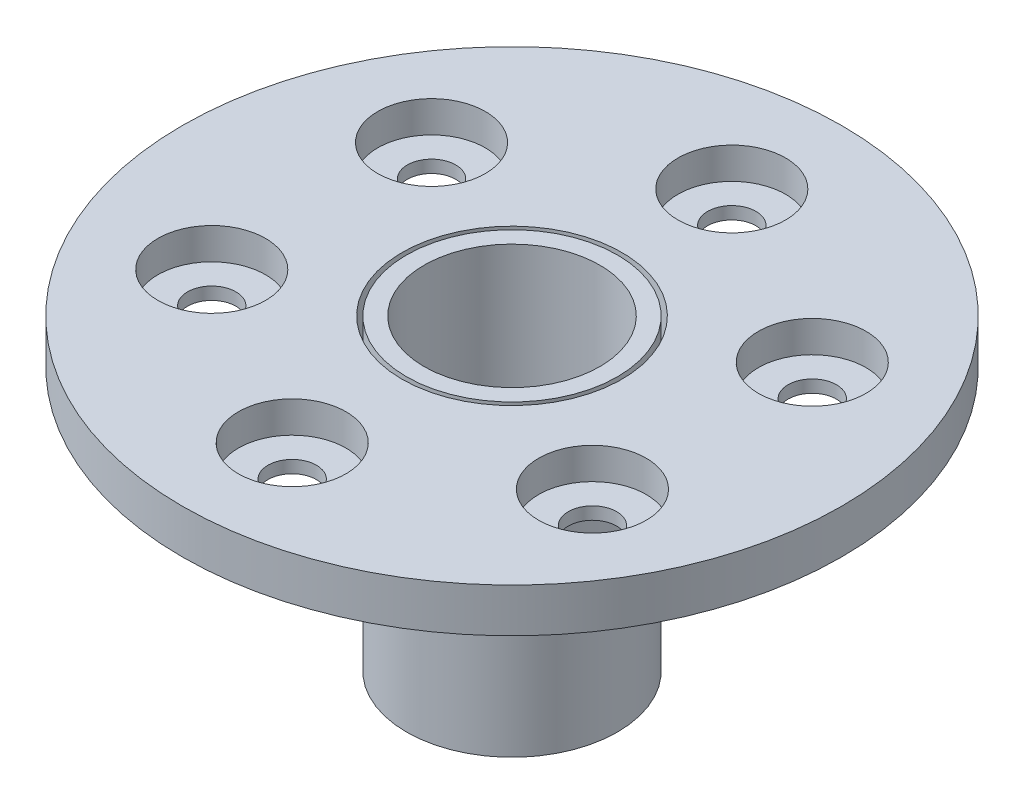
ISO-10303-21;
HEADER;
FILE_DESCRIPTION(('STEP AP214'),'2;1');
FILE_NAME('part.step','',(''),(''),'','','');
FILE_SCHEMA(('AUTOMOTIVE_DESIGN { 1 0 10303 214 1 1 1 1 }'));
ENDSEC;
DATA;
#1=APPLICATION_CONTEXT('core data for automotive mechanical design processes');
#2=APPLICATION_PROTOCOL_DEFINITION('international standard','automotive_design',2000,#1);
#3=PRODUCT_CONTEXT('',#1,'mechanical');
#4=PRODUCT('Part','Part','',(#3));
#5=PRODUCT_RELATED_PRODUCT_CATEGORY('part','',(#4));
#6=PRODUCT_DEFINITION_FORMATION('','',#4);
#7=PRODUCT_DEFINITION_CONTEXT('part definition',#1,'design');
#8=PRODUCT_DEFINITION('design','',#6,#7);
#9=PRODUCT_DEFINITION_SHAPE('','',#8);
#10=(LENGTH_UNIT() NAMED_UNIT(*) SI_UNIT(.MILLI.,.METRE.));
#11=(NAMED_UNIT(*) PLANE_ANGLE_UNIT() SI_UNIT($,.RADIAN.));
#12=(NAMED_UNIT(*) SI_UNIT($,.STERADIAN.) SOLID_ANGLE_UNIT());
#13=UNCERTAINTY_MEASURE_WITH_UNIT(LENGTH_MEASURE(1.E-05),#10,'distance_accuracy_value','');
#14=(GEOMETRIC_REPRESENTATION_CONTEXT(3) GLOBAL_UNCERTAINTY_ASSIGNED_CONTEXT((#13)) GLOBAL_UNIT_ASSIGNED_CONTEXT((#10,
#11,#12)) REPRESENTATION_CONTEXT('',''));
#15=CARTESIAN_POINT('',(0.,0.,0.));
#16=DIRECTION('',(0.,0.,1.));
#17=DIRECTION('',(1.,0.,0.));
#18=AXIS2_PLACEMENT_3D('',#15,#16,#17);
#19=CARTESIAN_POINT('',(0.,-30.,0.));
#20=DIRECTION('',(0.,1.,0.));
#21=DIRECTION('',(0.,0.,1.));
#22=AXIS2_PLACEMENT_3D('',#19,#20,#21);
#23=CYLINDRICAL_SURFACE('',#22,12.);
#24=CARTESIAN_POINT('',(0.,-30.,0.));
#25=DIRECTION('',(0.,1.,0.));
#26=DIRECTION('',(0.,0.,1.));
#27=AXIS2_PLACEMENT_3D('',#24,#25,#26);
#28=CIRCLE('',#27,12.);
#29=CARTESIAN_POINT('',(0.,-30.,12.));
#30=VERTEX_POINT('',#29);
#31=EDGE_CURVE('E11',#30,#30,#28,.T.);
#32=ORIENTED_EDGE('',*,*,#31,.T.);
#33=EDGE_LOOP('',(#32));
#34=FACE_BOUND('',#33,.T.);
#35=CARTESIAN_POINT('',(0.,5.,0.));
#36=DIRECTION('',(0.,1.,0.));
#37=DIRECTION('',(0.,0.,1.));
#38=AXIS2_PLACEMENT_3D('',#35,#36,#37);
#39=CIRCLE('',#38,12.);
#40=CARTESIAN_POINT('',(0.,5.,12.));
#41=VERTEX_POINT('',#40);
#42=EDGE_CURVE('E45',#41,#41,#39,.T.);
#43=ORIENTED_EDGE('',*,*,#42,.F.);
#44=EDGE_LOOP('',(#43));
#45=FACE_BOUND('',#44,.T.);
#46=ADVANCED_FACE('F39',(#34,#45),#23,.T.);
#47=CARTESIAN_POINT('',(0.,-30.,0.));
#48=DIRECTION('',(0.,1.,0.));
#49=DIRECTION('',(0.,0.,1.));
#50=AXIS2_PLACEMENT_3D('',#47,#48,#49);
#51=PLANE('',#50);
#52=CARTESIAN_POINT('',(0.,-30.,0.));
#53=DIRECTION('',(0.,1.,0.));
#54=DIRECTION('',(0.,0.,1.));
#55=AXIS2_PLACEMENT_3D('',#52,#53,#54);
#56=CIRCLE('',#55,10.);
#57=CARTESIAN_POINT('',(0.,-30.,10.));
#58=VERTEX_POINT('',#57);
#59=EDGE_CURVE('E49',#58,#58,#56,.T.);
#60=ORIENTED_EDGE('',*,*,#59,.T.);
#61=EDGE_LOOP('',(#60));
#62=FACE_BOUND('',#61,.T.);
#63=ORIENTED_EDGE('',*,*,#31,.F.);
#64=EDGE_LOOP('',(#63));
#65=FACE_BOUND('',#64,.T.);
#66=ADVANCED_FACE('F63',(#62,#65),#51,.F.);
#67=CARTESIAN_POINT('',(0.,5.,0.));
#68=DIRECTION('',(0.,1.,0.));
#69=DIRECTION('',(0.,0.,1.));
#70=AXIS2_PLACEMENT_3D('',#67,#68,#69);
#71=PLANE('',#70);
#72=CARTESIAN_POINT('',(0.,5.,0.));
#73=DIRECTION('',(0.,1.,0.));
#74=DIRECTION('',(0.,0.,1.));
#75=AXIS2_PLACEMENT_3D('',#72,#73,#74);
#76=CIRCLE('',#75,10.);
#77=CARTESIAN_POINT('',(0.,5.,10.));
#78=VERTEX_POINT('',#77);
#79=EDGE_CURVE('E53',#78,#78,#76,.T.);
#80=ORIENTED_EDGE('',*,*,#79,.F.);
#81=EDGE_LOOP('',(#80));
#82=FACE_BOUND('',#81,.T.);
#83=ORIENTED_EDGE('',*,*,#42,.T.);
#84=EDGE_LOOP('',(#83));
#85=FACE_BOUND('',#84,.T.);
#86=ADVANCED_FACE('F61',(#82,#85),#71,.T.);
#87=CARTESIAN_POINT('',(0.,-30.,0.));
#88=DIRECTION('',(0.,1.,0.));
#89=DIRECTION('',(0.,0.,1.));
#90=AXIS2_PLACEMENT_3D('',#87,#88,#89);
#91=CYLINDRICAL_SURFACE('',#90,10.);
#92=ORIENTED_EDGE('',*,*,#59,.F.);
#93=EDGE_LOOP('',(#92));
#94=FACE_BOUND('',#93,.T.);
#95=ORIENTED_EDGE('',*,*,#79,.T.);
#96=EDGE_LOOP('',(#95));
#97=FACE_BOUND('',#96,.T.);
#98=ADVANCED_FACE('F59',(#94,#97),#91,.F.);
#99=CLOSED_SHELL('',(#46,#66,#86,#98));
#100=MANIFOLD_SOLID_BREP('B2',#99);
#101=CARTESIAN_POINT('',(0.,5.,0.));
#102=DIRECTION('',(0.,1.,0.));
#103=DIRECTION('',(0.,0.,1.));
#104=AXIS2_PLACEMENT_3D('',#101,#102,#103);
#105=PLANE('',#104);
#106=CARTESIAN_POINT('',(21.6506350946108,5.,12.5000000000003));
#107=DIRECTION('',(0.,1.,0.));
#108=DIRECTION('',(0.,0.,1.));
#109=AXIS2_PLACEMENT_3D('',#106,#107,#108);
#110=CIRCLE('',#109,6.12);
#111=CARTESIAN_POINT('',(21.6506350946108,5.,18.6200000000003));
#112=VERTEX_POINT('',#111);
#113=EDGE_CURVE('E178',#112,#112,#110,.T.);
#114=ORIENTED_EDGE('',*,*,#113,.F.);
#115=EDGE_LOOP('',(#114));
#116=FACE_BOUND('',#115,.T.);
#117=CARTESIAN_POINT('',(21.6506350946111,5.,-12.4999999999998));
#118=DIRECTION('',(0.,1.,0.));
#119=DIRECTION('',(0.,0.,1.));
#120=AXIS2_PLACEMENT_3D('',#117,#118,#119);
#121=CIRCLE('',#120,6.12);
#122=CARTESIAN_POINT('',(21.6506350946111,5.,-6.3799999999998));
#123=VERTEX_POINT('',#122);
#124=EDGE_CURVE('E166',#123,#123,#121,.T.);
#125=ORIENTED_EDGE('',*,*,#124,.F.);
#126=EDGE_LOOP('',(#125));
#127=FACE_BOUND('',#126,.T.);
#128=CARTESIAN_POINT('',(1.74574168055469E-13,5.,-25.));
#129=DIRECTION('',(0.,1.,0.));
#130=DIRECTION('',(0.,0.,1.));
#131=AXIS2_PLACEMENT_3D('',#128,#129,#130);
#132=CIRCLE('',#131,6.12);
#133=CARTESIAN_POINT('',(1.74574168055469E-13,5.,-18.88));
#134=VERTEX_POINT('',#133);
#135=EDGE_CURVE('E154',#134,#134,#132,.T.);
#136=ORIENTED_EDGE('',*,*,#135,.F.);
#137=EDGE_LOOP('',(#136));
#138=FACE_BOUND('',#137,.T.);
#139=CARTESIAN_POINT('',(-21.6506350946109,5.,-12.5000000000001));
#140=DIRECTION('',(0.,1.,0.));
#141=DIRECTION('',(0.,0.,1.));
#142=AXIS2_PLACEMENT_3D('',#139,#140,#141);
#143=CIRCLE('',#142,6.12);
#144=CARTESIAN_POINT('',(-21.6506350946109,5.,-6.3800000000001));
#145=VERTEX_POINT('',#144);
#146=EDGE_CURVE('E142',#145,#145,#143,.T.);
#147=ORIENTED_EDGE('',*,*,#146,.F.);
#148=EDGE_LOOP('',(#147));
#149=FACE_BOUND('',#148,.T.);
#150=CARTESIAN_POINT('',(-21.650635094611,5.,12.5));
#151=DIRECTION('',(0.,1.,0.));
#152=DIRECTION('',(0.,0.,1.));
#153=AXIS2_PLACEMENT_3D('',#150,#151,#152);
#154=CIRCLE('',#153,6.12);
#155=CARTESIAN_POINT('',(-21.650635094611,5.,18.6199999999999));
#156=VERTEX_POINT('',#155);
#157=EDGE_CURVE('E130',#156,#156,#154,.T.);
#158=ORIENTED_EDGE('',*,*,#157,.F.);
#159=EDGE_LOOP('',(#158));
#160=FACE_BOUND('',#159,.T.);
#161=CARTESIAN_POINT('',(0.,5.,25.));
#162=DIRECTION('',(0.,1.,0.));
#163=DIRECTION('',(0.,0.,1.));
#164=AXIS2_PLACEMENT_3D('',#161,#162,#163);
#165=CIRCLE('',#164,6.12);
#166=CARTESIAN_POINT('',(0.,5.,31.12));
#167=VERTEX_POINT('',#166);
#168=EDGE_CURVE('E121',#167,#167,#165,.T.);
#169=ORIENTED_EDGE('',*,*,#168,.F.);
#170=EDGE_LOOP('',(#169));
#171=FACE_BOUND('',#170,.T.);
#172=CARTESIAN_POINT('',(0.,5.,0.));
#173=DIRECTION('',(0.,1.,0.));
#174=DIRECTION('',(0.,0.,1.));
#175=AXIS2_PLACEMENT_3D('',#172,#173,#174);
#176=CIRCLE('',#175,37.5);
#177=CARTESIAN_POINT('',(0.,5.,37.5));
#178=VERTEX_POINT('',#177);
#179=EDGE_CURVE('E38',#178,#178,#176,.T.);
#180=ORIENTED_EDGE('',*,*,#179,.T.);
#181=EDGE_LOOP('',(#180));
#182=FACE_BOUND('',#181,.T.);
#183=CARTESIAN_POINT('',(0.,5.,0.));
#184=DIRECTION('',(0.,1.,0.));
#185=DIRECTION('',(0.,0.,1.));
#186=AXIS2_PLACEMENT_3D('',#183,#184,#185);
#187=CIRCLE('',#186,12.5);
#188=CARTESIAN_POINT('',(0.,5.,12.5));
#189=VERTEX_POINT('',#188);
#190=EDGE_CURVE('E113',#189,#189,#187,.T.);
#191=ORIENTED_EDGE('',*,*,#190,.F.);
#192=EDGE_LOOP('',(#191));
#193=FACE_BOUND('',#192,.T.);
#194=ADVANCED_FACE('F101',(#116,#127,#138,#149,#160,#171,#182,#193),#105,.T.);
#195=CARTESIAN_POINT('',(0.,0.,0.));
#196=DIRECTION('',(0.,1.,0.));
#197=DIRECTION('',(0.,0.,1.));
#198=AXIS2_PLACEMENT_3D('',#195,#196,#197);
#199=PLANE('',#198);
#200=CARTESIAN_POINT('',(21.6506350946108,0.,12.5000000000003));
#201=DIRECTION('',(0.,1.,0.));
#202=DIRECTION('',(0.,0.,1.));
#203=AXIS2_PLACEMENT_3D('',#200,#201,#202);
#204=CIRCLE('',#203,2.75);
#205=CARTESIAN_POINT('',(21.6506350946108,0.,15.2500000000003));
#206=VERTEX_POINT('',#205);
#207=EDGE_CURVE('E187',#206,#206,#204,.T.);
#208=ORIENTED_EDGE('',*,*,#207,.T.);
#209=EDGE_LOOP('',(#208));
#210=FACE_BOUND('',#209,.T.);
#211=CARTESIAN_POINT('',(21.6506350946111,0.,-12.4999999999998));
#212=DIRECTION('',(0.,1.,0.));
#213=DIRECTION('',(0.,0.,1.));
#214=AXIS2_PLACEMENT_3D('',#211,#212,#213);
#215=CIRCLE('',#214,2.75);
#216=CARTESIAN_POINT('',(21.6506350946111,0.,-9.7499999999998));
#217=VERTEX_POINT('',#216);
#218=EDGE_CURVE('E175',#217,#217,#215,.T.);
#219=ORIENTED_EDGE('',*,*,#218,.T.);
#220=EDGE_LOOP('',(#219));
#221=FACE_BOUND('',#220,.T.);
#222=CARTESIAN_POINT('',(1.74574168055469E-13,0.,-25.));
#223=DIRECTION('',(0.,1.,0.));
#224=DIRECTION('',(0.,0.,1.));
#225=AXIS2_PLACEMENT_3D('',#222,#223,#224);
#226=CIRCLE('',#225,2.75);
#227=CARTESIAN_POINT('',(1.74574168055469E-13,0.,-22.25));
#228=VERTEX_POINT('',#227);
#229=EDGE_CURVE('E163',#228,#228,#226,.T.);
#230=ORIENTED_EDGE('',*,*,#229,.T.);
#231=EDGE_LOOP('',(#230));
#232=FACE_BOUND('',#231,.T.);
#233=CARTESIAN_POINT('',(-21.6506350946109,0.,-12.5000000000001));
#234=DIRECTION('',(0.,1.,0.));
#235=DIRECTION('',(0.,0.,1.));
#236=AXIS2_PLACEMENT_3D('',#233,#234,#235);
#237=CIRCLE('',#236,2.75);
#238=CARTESIAN_POINT('',(-21.6506350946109,0.,-9.7500000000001));
#239=VERTEX_POINT('',#238);
#240=EDGE_CURVE('E151',#239,#239,#237,.T.);
#241=ORIENTED_EDGE('',*,*,#240,.T.);
#242=EDGE_LOOP('',(#241));
#243=FACE_BOUND('',#242,.T.);
#244=CARTESIAN_POINT('',(-21.650635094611,0.,12.5));
#245=DIRECTION('',(0.,1.,0.));
#246=DIRECTION('',(0.,0.,1.));
#247=AXIS2_PLACEMENT_3D('',#244,#245,#246);
#248=CIRCLE('',#247,2.75);
#249=CARTESIAN_POINT('',(-21.650635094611,0.,15.25));
#250=VERTEX_POINT('',#249);
#251=EDGE_CURVE('E139',#250,#250,#248,.T.);
#252=ORIENTED_EDGE('',*,*,#251,.T.);
#253=EDGE_LOOP('',(#252));
#254=FACE_BOUND('',#253,.T.);
#255=CARTESIAN_POINT('',(0.,0.,25.));
#256=DIRECTION('',(0.,1.,0.));
#257=DIRECTION('',(0.,0.,1.));
#258=AXIS2_PLACEMENT_3D('',#255,#256,#257);
#259=CIRCLE('',#258,2.75);
#260=CARTESIAN_POINT('',(0.,0.,27.75));
#261=VERTEX_POINT('',#260);
#262=EDGE_CURVE('E105',#261,#261,#259,.T.);
#263=ORIENTED_EDGE('',*,*,#262,.T.);
#264=EDGE_LOOP('',(#263));
#265=FACE_BOUND('',#264,.T.);
#266=CARTESIAN_POINT('',(0.,0.,0.));
#267=DIRECTION('',(0.,1.,0.));
#268=DIRECTION('',(0.,0.,1.));
#269=AXIS2_PLACEMENT_3D('',#266,#267,#268);
#270=CIRCLE('',#269,37.5);
#271=CARTESIAN_POINT('',(0.,0.,37.5));
#272=VERTEX_POINT('',#271);
#273=EDGE_CURVE('E109',#272,#272,#270,.T.);
#274=ORIENTED_EDGE('',*,*,#273,.F.);
#275=EDGE_LOOP('',(#274));
#276=FACE_BOUND('',#275,.T.);
#277=CARTESIAN_POINT('',(0.,0.,0.));
#278=DIRECTION('',(0.,1.,0.));
#279=DIRECTION('',(0.,0.,1.));
#280=AXIS2_PLACEMENT_3D('',#277,#278,#279);
#281=CIRCLE('',#280,12.5);
#282=CARTESIAN_POINT('',(0.,0.,12.5));
#283=VERTEX_POINT('',#282);
#284=EDGE_CURVE('E118',#283,#283,#281,.T.);
#285=ORIENTED_EDGE('',*,*,#284,.T.);
#286=EDGE_LOOP('',(#285));
#287=FACE_BOUND('',#286,.T.);
#288=ADVANCED_FACE('F191',(#210,#221,#232,#243,#254,#265,#276,#287),#199,.F.);
#289=CARTESIAN_POINT('',(0.,5.,0.));
#290=DIRECTION('',(0.,-1.,0.));
#291=DIRECTION('',(0.,0.,-1.));
#292=AXIS2_PLACEMENT_3D('',#289,#290,#291);
#293=CYLINDRICAL_SURFACE('',#292,37.5);
#294=ORIENTED_EDGE('',*,*,#179,.F.);
#295=EDGE_LOOP('',(#294));
#296=FACE_BOUND('',#295,.T.);
#297=ORIENTED_EDGE('',*,*,#273,.T.);
#298=EDGE_LOOP('',(#297));
#299=FACE_BOUND('',#298,.T.);
#300=ADVANCED_FACE('F103',(#296,#299),#293,.T.);
#301=CARTESIAN_POINT('',(0.,5.,0.));
#302=DIRECTION('',(0.,-1.,0.));
#303=DIRECTION('',(0.,0.,-1.));
#304=AXIS2_PLACEMENT_3D('',#301,#302,#303);
#305=CYLINDRICAL_SURFACE('',#304,12.5);
#306=ORIENTED_EDGE('',*,*,#190,.T.);
#307=EDGE_LOOP('',(#306));
#308=FACE_BOUND('',#307,.T.);
#309=ORIENTED_EDGE('',*,*,#284,.F.);
#310=EDGE_LOOP('',(#309));
#311=FACE_BOUND('',#310,.T.);
#312=ADVANCED_FACE('F227',(#308,#311),#305,.F.);
#313=CARTESIAN_POINT('',(0.,5.,25.));
#314=DIRECTION('',(0.,1.,0.));
#315=DIRECTION('',(0.,0.,1.));
#316=AXIS2_PLACEMENT_3D('',#313,#314,#315);
#317=CYLINDRICAL_SURFACE('',#316,2.75);
#318=CARTESIAN_POINT('',(0.,1.42,25.));
#319=DIRECTION('',(0.,1.,0.));
#320=DIRECTION('',(0.,0.,1.));
#321=AXIS2_PLACEMENT_3D('',#318,#319,#320);
#322=CIRCLE('',#321,2.75);
#323=CARTESIAN_POINT('',(0.,1.42,27.75));
#324=VERTEX_POINT('',#323);
#325=EDGE_CURVE('E127',#324,#324,#322,.T.);
#326=ORIENTED_EDGE('',*,*,#325,.T.);
#327=EDGE_LOOP('',(#326));
#328=FACE_BOUND('',#327,.T.);
#329=ORIENTED_EDGE('',*,*,#262,.F.);
#330=EDGE_LOOP('',(#329));
#331=FACE_BOUND('',#330,.T.);
#332=ADVANCED_FACE('F230',(#328,#331),#317,.F.);
#333=CARTESIAN_POINT('',(0.,5.,25.));
#334=DIRECTION('',(0.,1.,0.));
#335=DIRECTION('',(0.,0.,1.));
#336=AXIS2_PLACEMENT_3D('',#333,#334,#335);
#337=CYLINDRICAL_SURFACE('',#336,6.12);
#338=CARTESIAN_POINT('',(0.,1.42,25.));
#339=DIRECTION('',(0.,1.,0.));
#340=DIRECTION('',(0.,0.,1.));
#341=AXIS2_PLACEMENT_3D('',#338,#339,#340);
#342=CIRCLE('',#341,6.12);
#343=CARTESIAN_POINT('',(0.,1.42,31.12));
#344=VERTEX_POINT('',#343);
#345=EDGE_CURVE('E124',#344,#344,#342,.T.);
#346=ORIENTED_EDGE('',*,*,#345,.F.);
#347=EDGE_LOOP('',(#346));
#348=FACE_BOUND('',#347,.T.);
#349=ORIENTED_EDGE('',*,*,#168,.T.);
#350=EDGE_LOOP('',(#349));
#351=FACE_BOUND('',#350,.T.);
#352=ADVANCED_FACE('F241',(#348,#351),#337,.F.);
#353=CARTESIAN_POINT('',(2.75,1.42,25.));
#354=DIRECTION('',(0.,-1.,0.));
#355=DIRECTION('',(0.,0.,-1.));
#356=AXIS2_PLACEMENT_3D('',#353,#354,#355);
#357=PLANE('',#356);
#358=ORIENTED_EDGE('',*,*,#325,.F.);
#359=EDGE_LOOP('',(#358));
#360=FACE_BOUND('',#359,.T.);
#361=ORIENTED_EDGE('',*,*,#345,.T.);
#362=EDGE_LOOP('',(#361));
#363=FACE_BOUND('',#362,.T.);
#364=ADVANCED_FACE('F244',(#360,#363),#357,.F.);
#365=CARTESIAN_POINT('',(-21.650635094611,5.,12.5));
#366=DIRECTION('',(0.,1.,0.));
#367=DIRECTION('',(0.,0.,1.));
#368=AXIS2_PLACEMENT_3D('',#365,#366,#367);
#369=CYLINDRICAL_SURFACE('',#368,6.12);
#370=CARTESIAN_POINT('',(-21.650635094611,1.42,12.5));
#371=DIRECTION('',(0.,1.,0.));
#372=DIRECTION('',(0.,0.,1.));
#373=AXIS2_PLACEMENT_3D('',#370,#371,#372);
#374=CIRCLE('',#373,6.12);
#375=CARTESIAN_POINT('',(-21.650635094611,1.42,18.6199999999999));
#376=VERTEX_POINT('',#375);
#377=EDGE_CURVE('E133',#376,#376,#374,.T.);
#378=ORIENTED_EDGE('',*,*,#377,.F.);
#379=EDGE_LOOP('',(#378));
#380=FACE_BOUND('',#379,.T.);
#381=ORIENTED_EDGE('',*,*,#157,.T.);
#382=EDGE_LOOP('',(#381));
#383=FACE_BOUND('',#382,.T.);
#384=ADVANCED_FACE('F248',(#380,#383),#369,.F.);
#385=CARTESIAN_POINT('',(-18.900635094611,1.42,12.5));
#386=DIRECTION('',(0.,-1.,0.));
#387=DIRECTION('',(0.,0.,-1.));
#388=AXIS2_PLACEMENT_3D('',#385,#386,#387);
#389=PLANE('',#388);
#390=CARTESIAN_POINT('',(-21.650635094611,1.42,12.5));
#391=DIRECTION('',(0.,1.,0.));
#392=DIRECTION('',(0.,0.,1.));
#393=AXIS2_PLACEMENT_3D('',#390,#391,#392);
#394=CIRCLE('',#393,2.75);
#395=CARTESIAN_POINT('',(-21.650635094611,1.42,15.25));
#396=VERTEX_POINT('',#395);
#397=EDGE_CURVE('E136',#396,#396,#394,.T.);
#398=ORIENTED_EDGE('',*,*,#397,.F.);
#399=EDGE_LOOP('',(#398));
#400=FACE_BOUND('',#399,.T.);
#401=ORIENTED_EDGE('',*,*,#377,.T.);
#402=EDGE_LOOP('',(#401));
#403=FACE_BOUND('',#402,.T.);
#404=ADVANCED_FACE('F255',(#400,#403),#389,.F.);
#405=CARTESIAN_POINT('',(-21.650635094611,5.,12.5));
#406=DIRECTION('',(0.,1.,0.));
#407=DIRECTION('',(0.,0.,1.));
#408=AXIS2_PLACEMENT_3D('',#405,#406,#407);
#409=CYLINDRICAL_SURFACE('',#408,2.75);
#410=ORIENTED_EDGE('',*,*,#251,.F.);
#411=EDGE_LOOP('',(#410));
#412=FACE_BOUND('',#411,.T.);
#413=ORIENTED_EDGE('',*,*,#397,.T.);
#414=EDGE_LOOP('',(#413));
#415=FACE_BOUND('',#414,.T.);
#416=ADVANCED_FACE('F259',(#412,#415),#409,.F.);
#417=CARTESIAN_POINT('',(-21.6506350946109,5.,-12.5000000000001));
#418=DIRECTION('',(0.,1.,0.));
#419=DIRECTION('',(0.,0.,1.));
#420=AXIS2_PLACEMENT_3D('',#417,#418,#419);
#421=CYLINDRICAL_SURFACE('',#420,6.12);
#422=CARTESIAN_POINT('',(-21.6506350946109,1.42,-12.5000000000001));
#423=DIRECTION('',(0.,1.,0.));
#424=DIRECTION('',(0.,0.,1.));
#425=AXIS2_PLACEMENT_3D('',#422,#423,#424);
#426=CIRCLE('',#425,6.12);
#427=CARTESIAN_POINT('',(-21.6506350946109,1.42,-6.3800000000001));
#428=VERTEX_POINT('',#427);
#429=EDGE_CURVE('E145',#428,#428,#426,.T.);
#430=ORIENTED_EDGE('',*,*,#429,.F.);
#431=EDGE_LOOP('',(#430));
#432=FACE_BOUND('',#431,.T.);
#433=ORIENTED_EDGE('',*,*,#146,.T.);
#434=EDGE_LOOP('',(#433));
#435=FACE_BOUND('',#434,.T.);
#436=ADVANCED_FACE('F263',(#432,#435),#421,.F.);
#437=CARTESIAN_POINT('',(-18.9006350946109,1.42,-12.5000000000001));
#438=DIRECTION('',(0.,-1.,0.));
#439=DIRECTION('',(0.,0.,-1.));
#440=AXIS2_PLACEMENT_3D('',#437,#438,#439);
#441=PLANE('',#440);
#442=CARTESIAN_POINT('',(-21.6506350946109,1.42,-12.5000000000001));
#443=DIRECTION('',(0.,1.,0.));
#444=DIRECTION('',(0.,0.,1.));
#445=AXIS2_PLACEMENT_3D('',#442,#443,#444);
#446=CIRCLE('',#445,2.75);
#447=CARTESIAN_POINT('',(-21.6506350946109,1.42,-9.7500000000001));
#448=VERTEX_POINT('',#447);
#449=EDGE_CURVE('E148',#448,#448,#446,.T.);
#450=ORIENTED_EDGE('',*,*,#449,.F.);
#451=EDGE_LOOP('',(#450));
#452=FACE_BOUND('',#451,.T.);
#453=ORIENTED_EDGE('',*,*,#429,.T.);
#454=EDGE_LOOP('',(#453));
#455=FACE_BOUND('',#454,.T.);
#456=ADVANCED_FACE('F267',(#452,#455),#441,.F.);
#457=CARTESIAN_POINT('',(-21.6506350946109,5.,-12.5000000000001));
#458=DIRECTION('',(0.,1.,0.));
#459=DIRECTION('',(0.,0.,1.));
#460=AXIS2_PLACEMENT_3D('',#457,#458,#459);
#461=CYLINDRICAL_SURFACE('',#460,2.75);
#462=ORIENTED_EDGE('',*,*,#240,.F.);
#463=EDGE_LOOP('',(#462));
#464=FACE_BOUND('',#463,.T.);
#465=ORIENTED_EDGE('',*,*,#449,.T.);
#466=EDGE_LOOP('',(#465));
#467=FACE_BOUND('',#466,.T.);
#468=ADVANCED_FACE('F271',(#464,#467),#461,.F.);
#469=CARTESIAN_POINT('',(1.74574168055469E-13,5.,-25.));
#470=DIRECTION('',(0.,1.,0.));
#471=DIRECTION('',(0.,0.,1.));
#472=AXIS2_PLACEMENT_3D('',#469,#470,#471);
#473=CYLINDRICAL_SURFACE('',#472,6.12);
#474=CARTESIAN_POINT('',(1.74574168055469E-13,1.42,-25.));
#475=DIRECTION('',(0.,1.,0.));
#476=DIRECTION('',(0.,0.,1.));
#477=AXIS2_PLACEMENT_3D('',#474,#475,#476);
#478=CIRCLE('',#477,6.12);
#479=CARTESIAN_POINT('',(1.74574168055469E-13,1.42,-18.88));
#480=VERTEX_POINT('',#479);
#481=EDGE_CURVE('E157',#480,#480,#478,.T.);
#482=ORIENTED_EDGE('',*,*,#481,.F.);
#483=EDGE_LOOP('',(#482));
#484=FACE_BOUND('',#483,.T.);
#485=ORIENTED_EDGE('',*,*,#135,.T.);
#486=EDGE_LOOP('',(#485));
#487=FACE_BOUND('',#486,.T.);
#488=ADVANCED_FACE('F275',(#484,#487),#473,.F.);
#489=CARTESIAN_POINT('',(2.75000000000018,1.42,-25.));
#490=DIRECTION('',(0.,-1.,0.));
#491=DIRECTION('',(0.,0.,-1.));
#492=AXIS2_PLACEMENT_3D('',#489,#490,#491);
#493=PLANE('',#492);
#494=CARTESIAN_POINT('',(1.74574168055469E-13,1.42,-25.));
#495=DIRECTION('',(0.,1.,0.));
#496=DIRECTION('',(0.,0.,1.));
#497=AXIS2_PLACEMENT_3D('',#494,#495,#496);
#498=CIRCLE('',#497,2.75);
#499=CARTESIAN_POINT('',(1.74574168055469E-13,1.42,-22.25));
#500=VERTEX_POINT('',#499);
#501=EDGE_CURVE('E160',#500,#500,#498,.T.);
#502=ORIENTED_EDGE('',*,*,#501,.F.);
#503=EDGE_LOOP('',(#502));
#504=FACE_BOUND('',#503,.T.);
#505=ORIENTED_EDGE('',*,*,#481,.T.);
#506=EDGE_LOOP('',(#505));
#507=FACE_BOUND('',#506,.T.);
#508=ADVANCED_FACE('F279',(#504,#507),#493,.F.);
#509=CARTESIAN_POINT('',(1.74574168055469E-13,5.,-25.));
#510=DIRECTION('',(0.,1.,0.));
#511=DIRECTION('',(0.,0.,1.));
#512=AXIS2_PLACEMENT_3D('',#509,#510,#511);
#513=CYLINDRICAL_SURFACE('',#512,2.75);
#514=ORIENTED_EDGE('',*,*,#229,.F.);
#515=EDGE_LOOP('',(#514));
#516=FACE_BOUND('',#515,.T.);
#517=ORIENTED_EDGE('',*,*,#501,.T.);
#518=EDGE_LOOP('',(#517));
#519=FACE_BOUND('',#518,.T.);
#520=ADVANCED_FACE('F283',(#516,#519),#513,.F.);
#521=CARTESIAN_POINT('',(21.6506350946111,5.,-12.4999999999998));
#522=DIRECTION('',(0.,1.,0.));
#523=DIRECTION('',(0.,0.,1.));
#524=AXIS2_PLACEMENT_3D('',#521,#522,#523);
#525=CYLINDRICAL_SURFACE('',#524,6.12);
#526=CARTESIAN_POINT('',(21.6506350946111,1.42,-12.4999999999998));
#527=DIRECTION('',(0.,1.,0.));
#528=DIRECTION('',(0.,0.,1.));
#529=AXIS2_PLACEMENT_3D('',#526,#527,#528);
#530=CIRCLE('',#529,6.12);
#531=CARTESIAN_POINT('',(21.6506350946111,1.42,-6.3799999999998));
#532=VERTEX_POINT('',#531);
#533=EDGE_CURVE('E169',#532,#532,#530,.T.);
#534=ORIENTED_EDGE('',*,*,#533,.F.);
#535=EDGE_LOOP('',(#534));
#536=FACE_BOUND('',#535,.T.);
#537=ORIENTED_EDGE('',*,*,#124,.T.);
#538=EDGE_LOOP('',(#537));
#539=FACE_BOUND('',#538,.T.);
#540=ADVANCED_FACE('F287',(#536,#539),#525,.F.);
#541=CARTESIAN_POINT('',(24.4006350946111,1.42,-12.4999999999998));
#542=DIRECTION('',(0.,-1.,0.));
#543=DIRECTION('',(0.,0.,-1.));
#544=AXIS2_PLACEMENT_3D('',#541,#542,#543);
#545=PLANE('',#544);
#546=CARTESIAN_POINT('',(21.6506350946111,1.42,-12.4999999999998));
#547=DIRECTION('',(0.,1.,0.));
#548=DIRECTION('',(0.,0.,1.));
#549=AXIS2_PLACEMENT_3D('',#546,#547,#548);
#550=CIRCLE('',#549,2.75);
#551=CARTESIAN_POINT('',(21.6506350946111,1.42,-9.7499999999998));
#552=VERTEX_POINT('',#551);
#553=EDGE_CURVE('E172',#552,#552,#550,.T.);
#554=ORIENTED_EDGE('',*,*,#553,.F.);
#555=EDGE_LOOP('',(#554));
#556=FACE_BOUND('',#555,.T.);
#557=ORIENTED_EDGE('',*,*,#533,.T.);
#558=EDGE_LOOP('',(#557));
#559=FACE_BOUND('',#558,.T.);
#560=ADVANCED_FACE('F291',(#556,#559),#545,.F.);
#561=CARTESIAN_POINT('',(21.6506350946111,5.,-12.4999999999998));
#562=DIRECTION('',(0.,1.,0.));
#563=DIRECTION('',(0.,0.,1.));
#564=AXIS2_PLACEMENT_3D('',#561,#562,#563);
#565=CYLINDRICAL_SURFACE('',#564,2.75);
#566=ORIENTED_EDGE('',*,*,#218,.F.);
#567=EDGE_LOOP('',(#566));
#568=FACE_BOUND('',#567,.T.);
#569=ORIENTED_EDGE('',*,*,#553,.T.);
#570=EDGE_LOOP('',(#569));
#571=FACE_BOUND('',#570,.T.);
#572=ADVANCED_FACE('F209',(#568,#571),#565,.F.);
#573=CARTESIAN_POINT('',(21.6506350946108,5.,12.5000000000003));
#574=DIRECTION('',(0.,1.,0.));
#575=DIRECTION('',(0.,0.,1.));
#576=AXIS2_PLACEMENT_3D('',#573,#574,#575);
#577=CYLINDRICAL_SURFACE('',#576,6.12);
#578=CARTESIAN_POINT('',(21.6506350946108,1.42,12.5000000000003));
#579=DIRECTION('',(0.,1.,0.));
#580=DIRECTION('',(0.,0.,1.));
#581=AXIS2_PLACEMENT_3D('',#578,#579,#580);
#582=CIRCLE('',#581,6.12);
#583=CARTESIAN_POINT('',(21.6506350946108,1.42,18.6200000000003));
#584=VERTEX_POINT('',#583);
#585=EDGE_CURVE('E181',#584,#584,#582,.T.);
#586=ORIENTED_EDGE('',*,*,#585,.F.);
#587=EDGE_LOOP('',(#586));
#588=FACE_BOUND('',#587,.T.);
#589=ORIENTED_EDGE('',*,*,#113,.T.);
#590=EDGE_LOOP('',(#589));
#591=FACE_BOUND('',#590,.T.);
#592=ADVANCED_FACE('F203',(#588,#591),#577,.F.);
#593=CARTESIAN_POINT('',(24.4006350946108,1.42,12.5000000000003));
#594=DIRECTION('',(0.,-1.,0.));
#595=DIRECTION('',(0.,0.,-1.));
#596=AXIS2_PLACEMENT_3D('',#593,#594,#595);
#597=PLANE('',#596);
#598=CARTESIAN_POINT('',(21.6506350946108,1.42,12.5000000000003));
#599=DIRECTION('',(0.,1.,0.));
#600=DIRECTION('',(0.,0.,1.));
#601=AXIS2_PLACEMENT_3D('',#598,#599,#600);
#602=CIRCLE('',#601,2.75);
#603=CARTESIAN_POINT('',(21.6506350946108,1.42,15.2500000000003));
#604=VERTEX_POINT('',#603);
#605=EDGE_CURVE('E184',#604,#604,#602,.T.);
#606=ORIENTED_EDGE('',*,*,#605,.F.);
#607=EDGE_LOOP('',(#606));
#608=FACE_BOUND('',#607,.T.);
#609=ORIENTED_EDGE('',*,*,#585,.T.);
#610=EDGE_LOOP('',(#609));
#611=FACE_BOUND('',#610,.T.);
#612=ADVANCED_FACE('F197',(#608,#611),#597,.F.);
#613=CARTESIAN_POINT('',(21.6506350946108,5.,12.5000000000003));
#614=DIRECTION('',(0.,1.,0.));
#615=DIRECTION('',(0.,0.,1.));
#616=AXIS2_PLACEMENT_3D('',#613,#614,#615);
#617=CYLINDRICAL_SURFACE('',#616,2.75);
#618=ORIENTED_EDGE('',*,*,#207,.F.);
#619=EDGE_LOOP('',(#618));
#620=FACE_BOUND('',#619,.T.);
#621=ORIENTED_EDGE('',*,*,#605,.T.);
#622=EDGE_LOOP('',(#621));
#623=FACE_BOUND('',#622,.T.);
#624=ADVANCED_FACE('F194',(#620,#623),#617,.F.);
#625=CLOSED_SHELL('',(#194,#288,#300,#312,#332,#352,#364,#384,#404,#416,#436,#456,#468,#488,
#508,#520,#540,#560,#572,#592,#612,#624));
#626=MANIFOLD_SOLID_BREP('B6',#625);
#627=ADVANCED_BREP_SHAPE_REPRESENTATION('',(#18,#100,#626),#14);
#628=SHAPE_DEFINITION_REPRESENTATION(#9,#627);
ENDSEC;
END-ISO-10303-21;
